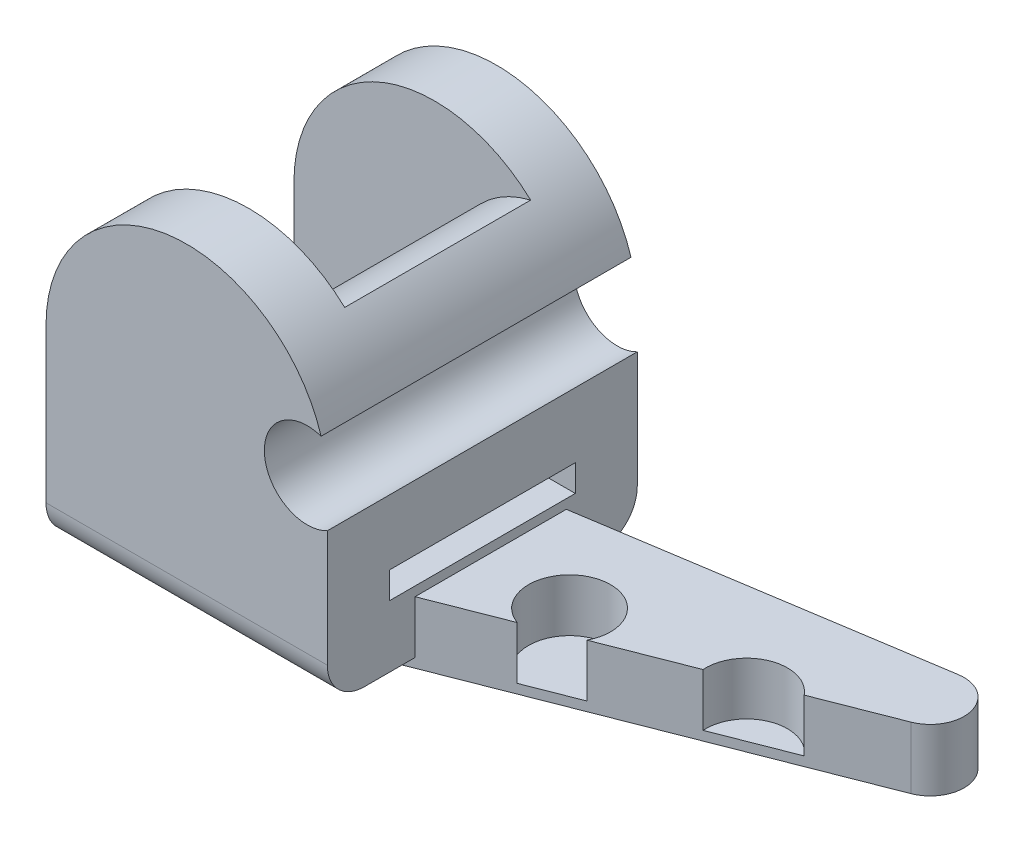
from build123d import *

# Parameters (mm, degrees)
U_SHAPE_DEPTH        = 100
SKETCH8_R            = 13.870670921
INNER_HOLE_DEPTH     = 126.918394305
THICKNESS_T          = -20
FILLET_2_R           = 12
TONGUE_DEPTH         = 20
SKETCH9_R            = 13.219756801
MOUNTING_HOLES_DEPTH = 223.42572915


with BuildPart() as part:
    # Sketch4 → U_ shape (new body)
    with BuildSketch(Plane.XY):
        with BuildLine():
            Line((-45.388843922, 0), (-45.388843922, -61.60596458))
            Line((-45.388843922, -61.60596458), (45.388843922, -61.60596458))
            Line((45.388843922, -61.60596458), (45.388843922, 0))
            ThreePointArc((45.388843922, 0), (0, 45.388843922), (-45.388843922, 0))
        make_face()
    extrude(amount=U_SHAPE_DEPTH)

    # Sketch8 → Inner Hole (cut, through all)
    with BuildSketch(Plane.XY.offset(100)):
        with Locations((38.923783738, 0.23491683)):
            Circle(SKETCH8_R)
    extrude(amount=-INNER_HOLE_DEPTH, mode=Mode.SUBTRACT)

    # Thickness
    thickness_openings = [part.faces().sort_by_distance(p)[0] for p in [
        (45.388843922, -36.821453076, 50),
        (-45.388843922, -30.80298229, 50),
        (-6.761547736, 44.882386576, 50),
    ]]
    offset(amount=THICKNESS_T, openings=thickness_openings, kind=Kind.INTERSECTION)

    # Fillet 2
    fillet_2_edges = [part.edges().sort_by_distance(p)[0] for p in [
        (0, -61.60596458, 100),
        (0, -61.60596458, 0),
    ]]
    fillet(fillet_2_edges, radius=FILLET_2_R)

    # Sketch7 → Tongue (add)
    with BuildSketch(Plane.XZ.offset(64.60596458)):
        with BuildLine():
            Line((24.518796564, 26.143873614), (154.843931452, 5.821988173))
            ThreePointArc((154.843931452, 5.821988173), (167.031484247, 13.741465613), (160.484216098, 26.717899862))
            Line((160.484216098, 26.717899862), (37.634315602, 74.733748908))
            Line((37.634315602, 74.733748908), (24.518796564, 26.143873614))
        make_face()
    extrude(amount=-TONGUE_DEPTH)

    # Sketch9 → Mounting Holes (cut, through all)
    with BuildSketch(Plane.XZ.offset(61.60596458)):
        with Locations((73.545474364, 50)):
            Circle(SKETCH9_R)
        with Locations((125.389042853, 44.726843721)):
            Circle(SKETCH9_R)
    extrude(amount=-MOUNTING_HOLES_DEPTH, mode=Mode.SUBTRACT)


solid = part.part
